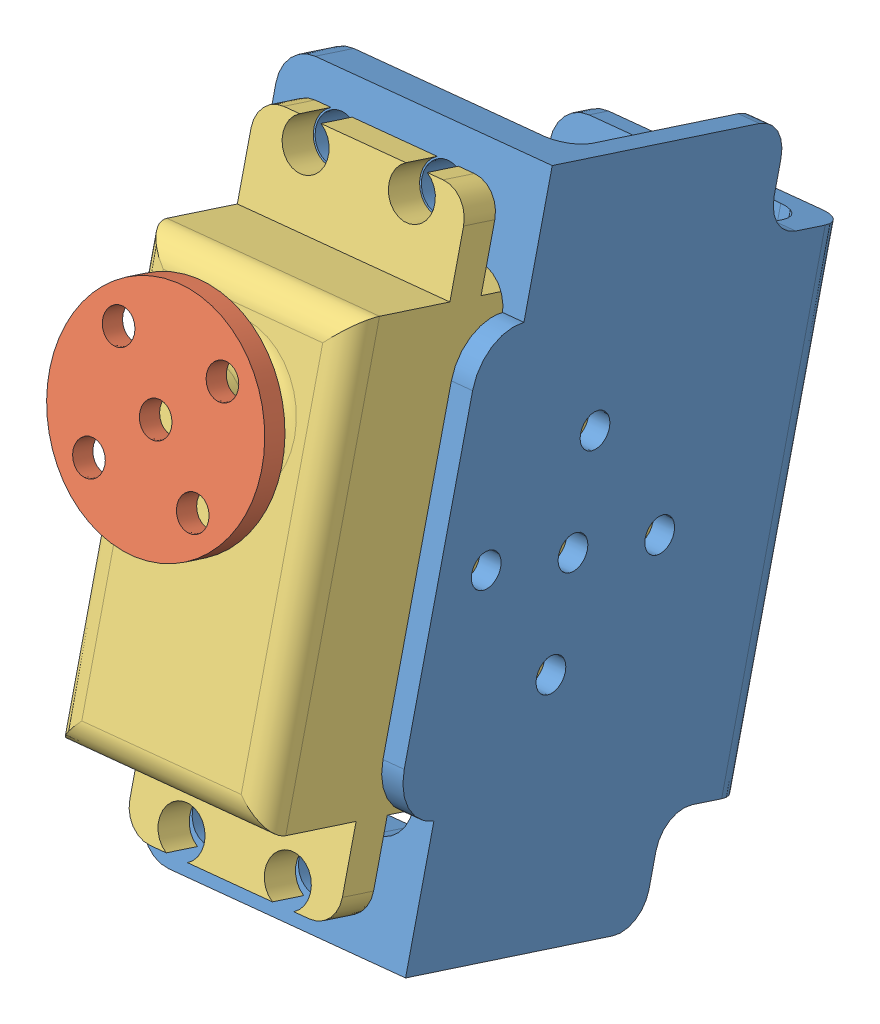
SolidWorks assembly Motor assem.SLDASM, configuration Default (file format 9000). Lengths in mm.
Overall size (31.03 71.38 67.2).
3 component instances, 3 part files, 7 mates.
Components (placement in the parent):
- Holder-1: Holder.SLDPRT [默认] at (-0.7795 -30.4339 -19.9159) x (-0.075978 0.946413 -0.313896) z (-0.997034 -0.068232 0.035609) size (59.9 36.96 25.4)
- Top of motor-SR1501-1: Top of motor-SR1501.SLDPRT [默认] at (-15.1658 -12.6142 8.5115) x (-0.68996 -0.684108 0.236541) z (-0.723744 0.657532 -0.209397) size (20 2.1 20)
- Motor SR-1501-3: Motor SR-1501.SLDPRT [默认] at (-14.6805 -27.161 -5.774) x (-0.075978 0.946413 -0.313896) z (0.997034 0.068232 -0.035609) size (54.5 46.38 20)
Mates (geometry in assembly coordinates):
- Parallel6: parallel anti-aligned: plane of Holder-1 through (-26.3066 -37.3692 -34.6475) normal (0.012283 0.31567 0.948789); plane of Motor SR-1501-3 through (-15.0273 -36.0756 -32.5679) normal (-0.012283 -0.31567 -0.948789)
- Concentric5: concentric anti-aligned: cylinder of Holder-1 through (-21.7134 -6.6811 -23.0366) axis (0.012283 0.31567 0.948789) radius 2; cylinder of Motor SR-1501-3 through (-21.5508 -2.5017 -10.4746) axis (-0.012283 -0.31567 -0.948789) radius 2.16
- Parallel9: parallel anti-aligned: plane of Holder-1 through (-2.7736 -30.5704 -19.8446) normal (-0.997034 -0.068232 0.035609); plane of Motor SR-1501-3 through (-4.6703 -25.456 -3.0561) normal (0.997034 0.068232 -0.035609)
- Concentric9: concentric aligned: cylinder of Top of motor-SR1501-1 through (-15.14 -11.9513 10.5039) axis (-0.012283 -0.31567 -0.948789) radius 1.5; cylinder of Motor SR-1501-3 through (-15.1658 -12.6142 8.5115) axis (-0.012283 -0.31567 -0.948789) radius 4.04
- Coincident20: coincident anti-aligned: plane of Holder-1 through (-2.5982 -26.0626 -6.2959) normal (0.012283 0.31567 0.948789); plane of Motor SR-1501-3 through (-14.6805 -27.161 -5.774) normal (-0.012283 -0.31567 -0.948789)
- Coincident21: coincident anti-aligned: plane of Top of motor-SR1501-1 through (-15.1658 -12.6142 8.5115) normal (-0.012283 -0.31567 -0.948789); circle of Motor SR-1501-3
- Coincident22: coincident anti-aligned: plane of Top of motor-SR1501-1 through (-15.1658 -12.6142 8.5115) normal (-0.012283 -0.31567 -0.948789); plane of Motor SR-1501-3 through (-15.1658 -12.6142 8.5115) normal (0.012283 0.31567 0.948789)
